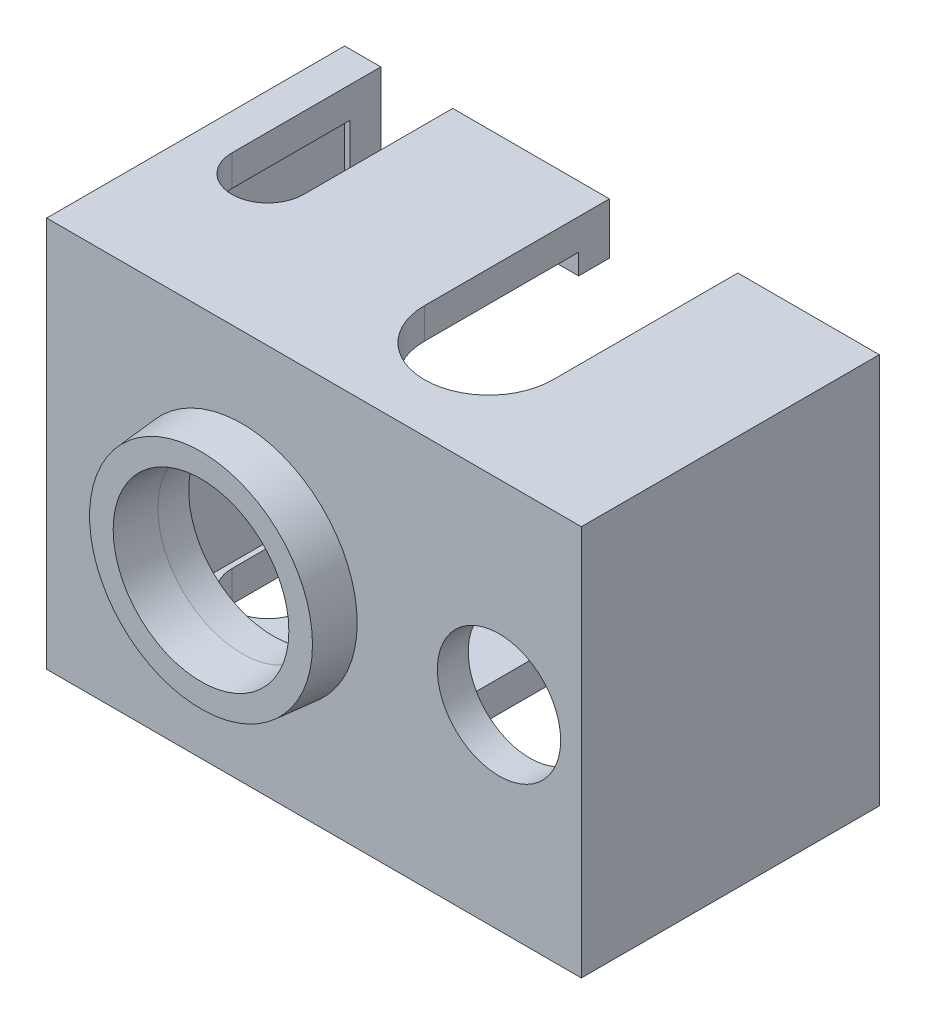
from build123d import *

# Parameters (mm, degrees)
SKETCH1_W           = 26.02
SKETCH1_H           = 19.02
SKETCH1_W_2         = 23.02
SKETCH1_H_2         = 16.02
BOSS_EXTRUDE1_DEPTH = 11.5
SKETCH2_W           = 26.02
SKETCH2_H           = 19.02
SKETCH2_W_2         = 21.02
SKETCH2_H_2         = 14.02
BOSS_EXTRUDE2_DEPTH = 1.5
SKETCH3_W           = 26.02
SKETCH3_H           = 19.02
SKETCH3_R           = 4.1
BOSS_EXTRUDE3_DEPTH = 1.5
SKETCH4_R           = 5.6
SKETCH4_R_2         = 4.1
BOSS_EXTRUDE4_DEPTH = 2
BOSS_EXTRUDE4_DRAFT = 5
SKETCH5_R           = 3
CUT_EXTRUDE1_DEPTH  = 1.5
CUT_EXTRUDE2_DEPTH  = 29.343261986


with BuildPart() as part:
    # Sketch1 → Boss-Extrude1 (new body)
    with BuildSketch(Plane.XY):
        with Locations((3.5, 0)):
            Rectangle(SKETCH1_W, SKETCH1_H)
        with Locations((3.5, 0)):
            Rectangle(SKETCH1_W_2, SKETCH1_H_2, mode=Mode.SUBTRACT)
    extrude(amount=-BOSS_EXTRUDE1_DEPTH)

    # Sketch2 → Boss-Extrude2 (add)
    with BuildSketch(Plane(origin=(0, 0, -11.5), x_dir=(-1, 0, 0), z_dir=(0, 0, -1))):
        with Locations((-3.5, 0)):
            Rectangle(SKETCH2_W, SKETCH2_H)
        with Locations((-3.5, 0)):
            Rectangle(SKETCH2_W_2, SKETCH2_H_2, mode=Mode.SUBTRACT)
    extrude(amount=BOSS_EXTRUDE2_DEPTH)

    # Sketch3 → Boss-Extrude3 (add)
    with BuildSketch(Plane.XY):
        with Locations((3.5, 0)):
            Rectangle(SKETCH3_W, SKETCH3_H)
        Circle(SKETCH3_R, mode=Mode.SUBTRACT)
    extrude(amount=BOSS_EXTRUDE3_DEPTH)


with BuildPart() as boss_extrude4_tool:
    # Sketch4 → Boss-Extrude4 (with draft: the straight prism first)
    with BuildSketch(Plane.XY.offset(1.5)):
        Circle(SKETCH4_R)
        Circle(SKETCH4_R_2, mode=Mode.SUBTRACT)
    extrude(amount=BOSS_EXTRUDE4_DEPTH)
    # Boss-Extrude4: the draft: its side faces are tilted about the plane it starts from
    boss_extrude4_sides = [boss_extrude4_tool.faces().sort_by_distance(p)[0] for p in [
        (-5.6, 0, 2.5),
        (-4.1, 0, 2.5),
    ]]
    draft(boss_extrude4_sides, Plane.XY.offset(1.5), BOSS_EXTRUDE4_DRAFT)


with BuildPart() as part_1:
    add(part.part)

    # Boss-Extrude4: add boss_extrude4_tool
    add(boss_extrude4_tool.part)

    # Sketch5 → Cut-Extrude1 (cut)
    with BuildSketch(Plane.XY.offset(1.5)):
        with Locations((12.502526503, 1e-09)):
            Circle(SKETCH5_R)
    extrude(amount=-CUT_EXTRUDE1_DEPTH, mode=Mode.SUBTRACT)

    # Sketch6 → Cut-Extrude2 (cut, through all)
    with BuildSketch(Plane.XZ.offset(9.51)):
        with BuildLine():
            Line((3.375, -4), (3.375, -13))
            Line((3.375, -13), (9.625, -13))
            Line((9.625, -13), (9.625, -4))
            ThreePointArc((9.625, -4), (6.5, -0.875), (3.375, -4))
        make_face()
        with BuildLine():
            Line((-4.25, -5.75), (-4.25, -13))
            Line((-4.25, -13), (-7.75, -13))
            Line((-7.75, -13), (-7.75, -5.75))
            ThreePointArc((-7.75, -5.75), (-6, -4), (-4.25, -5.75))
        make_face()
    extrude(amount=-CUT_EXTRUDE2_DEPTH, mode=Mode.SUBTRACT)


solid = part_1.part
